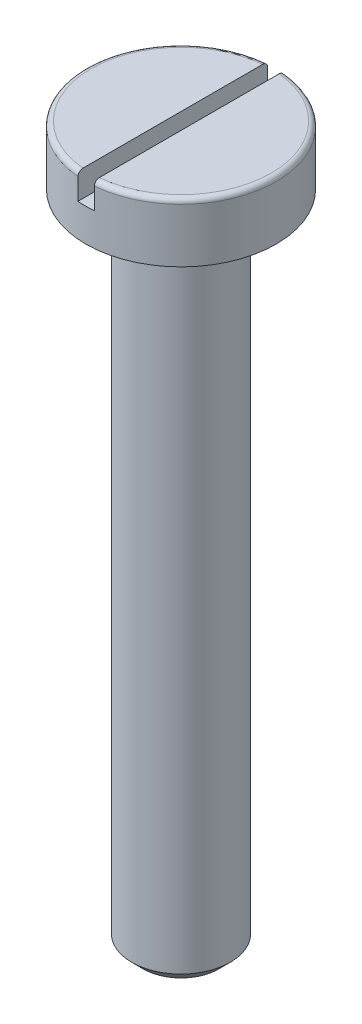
from build123d import *

# Parameters (mm, degrees)
ESQUISSE1_R             = 1.5
BASE_EXTRUSION_DEPTH    = 20
ESQUISSE2_R             = 2.9
BOSS_EXTRU_1_DEPTH      = 1.8
CONG_1_R                = 0.15
ENL_V_START             = -0.8
ENL_V_MAT_EXTRU_1_DEPTH = 0.8
CHANFREIN1_SIZE         = 0.35


with BuildPart() as part:
    # Esquisse1 → Base-Extrusion (new body)
    with BuildSketch(Plane(origin=(0, 0, 0), x_dir=(1, 0, 0), z_dir=(0, 1, 0))):
        with Locations(Location((0, 0, 0), (0, 0, 270))):
            Circle(ESQUISSE1_R)
    extrude(amount=-BASE_EXTRUSION_DEPTH)

    # Esquisse2 → Boss.-Extru.1 (add)
    with BuildSketch(Plane(origin=(0, 0, 0), x_dir=(-1, 0, 0), z_dir=(0, 1, 0))):
        with Locations(Location((0, 0, 0), (0, 0, 90))):
            Circle(ESQUISSE2_R)
    extrude(amount=BOSS_EXTRU_1_DEPTH)

    # Cong_1
    cong_1_edges = [part.edges().sort_by_distance(p)[0] for p in [
        (0, 1.8, -2.9),
    ]]
    fillet(cong_1_edges, radius=CONG_1_R)

    # Esquisse3 → Enl_v. mat.-Extru.1 (cut)
    with BuildSketch(Plane(origin=(0, 1.8, 0), x_dir=(-1, 0, 0), z_dir=(0, 1, 0)).offset(ENL_V_START)):
        with BuildLine():
            Line((-0.25, -2.889204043), (-0.25, 2.889204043))
            ThreePointArc((-0.25, 2.889204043), (0, 2.9), (0.25, 2.889204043))
            Line((0.25, 2.889204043), (0.25, -2.889204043))
            ThreePointArc((0.25, -2.889204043), (0, -2.9), (-0.25, -2.889204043))
        make_face()
    extrude(amount=ENL_V_MAT_EXTRU_1_DEPTH, mode=Mode.SUBTRACT)

    # Chanfrein1
    chanfrein1_edges = [part.edges().sort_by_distance(p)[0] for p in [
        (0, -20, -1.5),
    ]]
    chamfer(chanfrein1_edges, length=CHANFREIN1_SIZE)


solid = part.part
